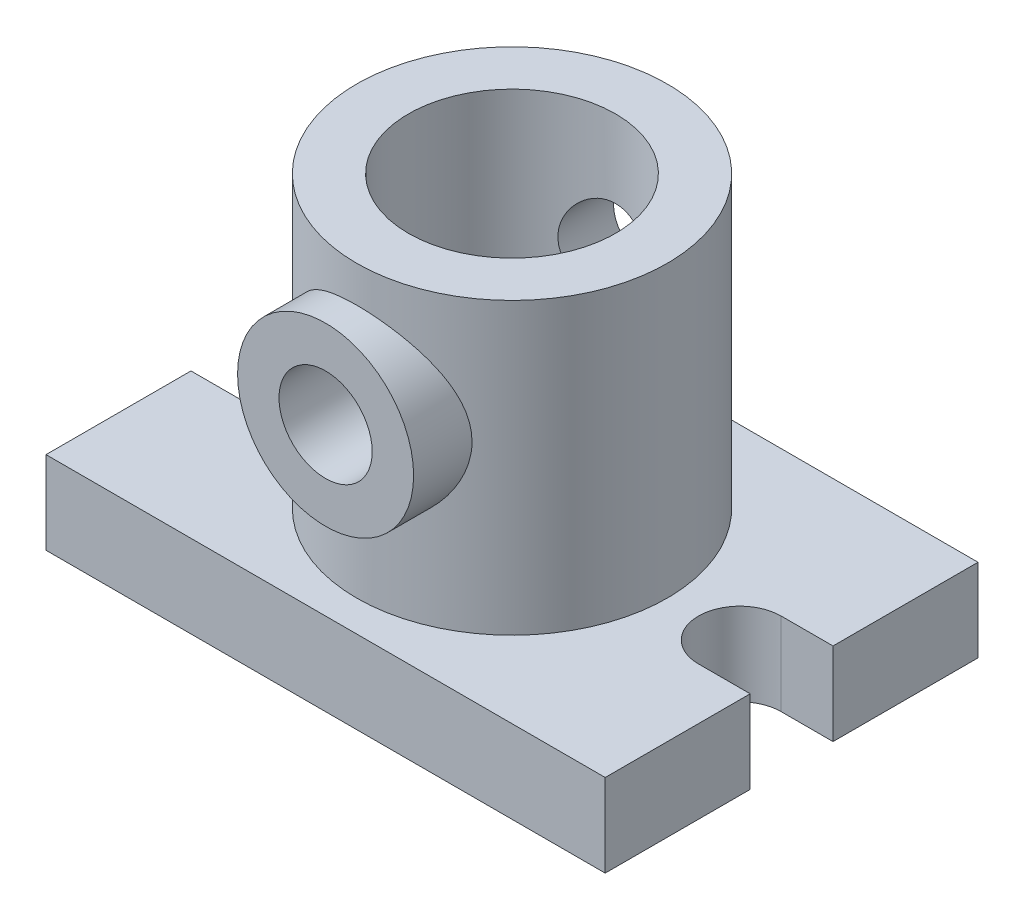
ISO-10303-21;
HEADER;
FILE_DESCRIPTION(('STEP AP214'),'2;1');
FILE_NAME('part.step','',(''),(''),'','','');
FILE_SCHEMA(('AUTOMOTIVE_DESIGN { 1 0 10303 214 1 1 1 1 }'));
ENDSEC;
DATA;
#1=APPLICATION_CONTEXT('core data for automotive mechanical design processes');
#2=APPLICATION_PROTOCOL_DEFINITION('international standard','automotive_design',2000,#1);
#3=PRODUCT_CONTEXT('',#1,'mechanical');
#4=PRODUCT('Part','Part','',(#3));
#5=PRODUCT_RELATED_PRODUCT_CATEGORY('part','',(#4));
#6=PRODUCT_DEFINITION_FORMATION('','',#4);
#7=PRODUCT_DEFINITION_CONTEXT('part definition',#1,'design');
#8=PRODUCT_DEFINITION('design','',#6,#7);
#9=PRODUCT_DEFINITION_SHAPE('','',#8);
#10=(LENGTH_UNIT() NAMED_UNIT(*) SI_UNIT(.MILLI.,.METRE.));
#11=(NAMED_UNIT(*) PLANE_ANGLE_UNIT() SI_UNIT($,.RADIAN.));
#12=(NAMED_UNIT(*) SI_UNIT($,.STERADIAN.) SOLID_ANGLE_UNIT());
#13=UNCERTAINTY_MEASURE_WITH_UNIT(LENGTH_MEASURE(1.E-05),#10,'distance_accuracy_value','');
#14=(GEOMETRIC_REPRESENTATION_CONTEXT(3) GLOBAL_UNCERTAINTY_ASSIGNED_CONTEXT((#13)) GLOBAL_UNIT_ASSIGNED_CONTEXT((#10,
#11,#12)) REPRESENTATION_CONTEXT('',''));
#15=CARTESIAN_POINT('',(0.,0.,0.));
#16=DIRECTION('',(0.,0.,1.));
#17=DIRECTION('',(1.,0.,0.));
#18=AXIS2_PLACEMENT_3D('',#15,#16,#17);
#19=CARTESIAN_POINT('',(0.,8.,0.));
#20=DIRECTION('',(0.,-1.,0.));
#21=DIRECTION('',(0.,0.,-1.));
#22=AXIS2_PLACEMENT_3D('',#19,#20,#21);
#23=CYLINDRICAL_SURFACE('',#22,4.5);
#24=CARTESIAN_POINT('',(0.,0.,0.));
#25=DIRECTION('',(0.,1.,0.));
#26=DIRECTION('',(0.,0.,1.));
#27=AXIS2_PLACEMENT_3D('',#24,#25,#26);
#28=CIRCLE('',#27,4.5);
#29=CARTESIAN_POINT('',(0.,0.,4.5));
#30=VERTEX_POINT('',#29);
#31=EDGE_CURVE('E159',#30,#30,#28,.T.);
#32=ORIENTED_EDGE('',*,*,#31,.F.);
#33=EDGE_LOOP('',(#32));
#34=FACE_BOUND('',#33,.T.);
#35=CARTESIAN_POINT('',(0.,13.,0.));
#36=DIRECTION('',(0.,1.,0.));
#37=DIRECTION('',(0.,0.,1.));
#38=AXIS2_PLACEMENT_3D('',#35,#36,#37);
#39=CIRCLE('',#38,4.5);
#40=CARTESIAN_POINT('',(0.,13.,4.5));
#41=VERTEX_POINT('',#40);
#42=EDGE_CURVE('E201',#41,#41,#39,.T.);
#43=ORIENTED_EDGE('',*,*,#42,.T.);
#44=EDGE_LOOP('',(#43));
#45=FACE_BOUND('',#44,.T.);
#46=ADVANCED_FACE('F31',(#34,#45),#23,.F.);
#47=CARTESIAN_POINT('',(-22.,8.,0.));
#48=DIRECTION('',(0.,1.,0.));
#49=DIRECTION('',(0.,0.,1.));
#50=AXIS2_PLACEMENT_3D('',#47,#48,#49);
#51=PLANE('',#50);
#52=DIRECTION('',(0.,0.,-1.));
#53=VECTOR('',#52,1.);
#54=CARTESIAN_POINT('',(27.,8.,-4.00000000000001));
#55=LINE('',#54,#53);
#56=CARTESIAN_POINT('',(27.,8.,-4.00000000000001));
#57=VERTEX_POINT('',#56);
#58=CARTESIAN_POINT('',(27.,8.,-18.));
#59=VERTEX_POINT('',#58);
#60=EDGE_CURVE('E178',#57,#59,#55,.T.);
#61=ORIENTED_EDGE('',*,*,#60,.T.);
#62=DIRECTION('',(-1.,0.,0.));
#63=VECTOR('',#62,1.);
#64=CARTESIAN_POINT('',(-27.,8.,-18.));
#65=LINE('',#64,#63);
#66=CARTESIAN_POINT('',(-27.,8.,-18.));
#67=VERTEX_POINT('',#66);
#68=EDGE_CURVE('E105',#59,#67,#65,.T.);
#69=ORIENTED_EDGE('',*,*,#68,.T.);
#70=DIRECTION('',(0.,0.,1.));
#71=VECTOR('',#70,1.);
#72=CARTESIAN_POINT('',(-27.,8.,-4.00000000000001));
#73=LINE('',#72,#71);
#74=CARTESIAN_POINT('',(-27.,8.,-4.00000000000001));
#75=VERTEX_POINT('',#74);
#76=EDGE_CURVE('E232',#67,#75,#73,.T.);
#77=ORIENTED_EDGE('',*,*,#76,.T.);
#78=DIRECTION('',(1.,0.,0.));
#79=VECTOR('',#78,1.);
#80=CARTESIAN_POINT('',(-22.,8.,-4.00000000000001));
#81=LINE('',#80,#79);
#82=CARTESIAN_POINT('',(-22.,8.,-4.00000000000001));
#83=VERTEX_POINT('',#82);
#84=EDGE_CURVE('E234',#75,#83,#81,.T.);
#85=ORIENTED_EDGE('',*,*,#84,.T.);
#86=CARTESIAN_POINT('',(-22.,8.,0.));
#87=DIRECTION('',(0.,-1.,0.));
#88=DIRECTION('',(0.,0.,1.));
#89=AXIS2_PLACEMENT_3D('',#86,#87,#88);
#90=CIRCLE('',#89,4.00000000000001);
#91=CARTESIAN_POINT('',(-22.,8.,4.00000000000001));
#92=VERTEX_POINT('',#91);
#93=EDGE_CURVE('E236',#83,#92,#90,.T.);
#94=ORIENTED_EDGE('',*,*,#93,.T.);
#95=DIRECTION('',(-1.,0.,0.));
#96=VECTOR('',#95,1.);
#97=CARTESIAN_POINT('',(-22.,8.,4.00000000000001));
#98=LINE('',#97,#96);
#99=CARTESIAN_POINT('',(-27.,8.,4.00000000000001));
#100=VERTEX_POINT('',#99);
#101=EDGE_CURVE('E238',#92,#100,#98,.T.);
#102=ORIENTED_EDGE('',*,*,#101,.T.);
#103=DIRECTION('',(0.,0.,1.));
#104=VECTOR('',#103,1.);
#105=CARTESIAN_POINT('',(-27.,8.,4.00000000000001));
#106=LINE('',#105,#104);
#107=CARTESIAN_POINT('',(-27.,8.,18.));
#108=VERTEX_POINT('',#107);
#109=EDGE_CURVE('E240',#100,#108,#106,.T.);
#110=ORIENTED_EDGE('',*,*,#109,.T.);
#111=DIRECTION('',(1.,0.,0.));
#112=VECTOR('',#111,1.);
#113=CARTESIAN_POINT('',(-27.,8.,18.));
#114=LINE('',#113,#112);
#115=CARTESIAN_POINT('',(27.,8.,18.));
#116=VERTEX_POINT('',#115);
#117=EDGE_CURVE('E242',#108,#116,#114,.T.);
#118=ORIENTED_EDGE('',*,*,#117,.T.);
#119=DIRECTION('',(0.,0.,-1.));
#120=VECTOR('',#119,1.);
#121=CARTESIAN_POINT('',(27.,8.,4.00000000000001));
#122=LINE('',#121,#120);
#123=CARTESIAN_POINT('',(27.,8.,4.00000000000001));
#124=VERTEX_POINT('',#123);
#125=EDGE_CURVE('E137',#116,#124,#122,.T.);
#126=ORIENTED_EDGE('',*,*,#125,.T.);
#127=DIRECTION('',(-1.,0.,0.));
#128=VECTOR('',#127,1.);
#129=CARTESIAN_POINT('',(22.,8.,4.00000000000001));
#130=LINE('',#129,#128);
#131=CARTESIAN_POINT('',(22.,8.,4.00000000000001));
#132=VERTEX_POINT('',#131);
#133=EDGE_CURVE('E130',#124,#132,#130,.T.);
#134=ORIENTED_EDGE('',*,*,#133,.T.);
#135=CARTESIAN_POINT('',(22.,8.,0.));
#136=DIRECTION('',(0.,-1.,0.));
#137=DIRECTION('',(0.,0.,-1.));
#138=AXIS2_PLACEMENT_3D('',#135,#136,#137);
#139=CIRCLE('',#138,4.00000000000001);
#140=CARTESIAN_POINT('',(22.,8.,-4.00000000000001));
#141=VERTEX_POINT('',#140);
#142=EDGE_CURVE('E135',#132,#141,#139,.T.);
#143=ORIENTED_EDGE('',*,*,#142,.T.);
#144=DIRECTION('',(1.,0.,0.));
#145=VECTOR('',#144,1.);
#146=CARTESIAN_POINT('',(22.,8.,-4.00000000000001));
#147=LINE('',#146,#145);
#148=EDGE_CURVE('E50',#141,#57,#147,.T.);
#149=ORIENTED_EDGE('',*,*,#148,.T.);
#150=EDGE_LOOP('',(#61,#69,#77,#85,#94,#102,#110,#118,#126,#134,#143,#149));
#151=FACE_BOUND('',#150,.T.);
#152=CARTESIAN_POINT('',(0.,8.,0.));
#153=DIRECTION('',(0.,1.,0.));
#154=DIRECTION('',(0.,0.,1.));
#155=AXIS2_PLACEMENT_3D('',#152,#153,#154);
#156=CIRCLE('',#155,15.);
#157=CARTESIAN_POINT('',(0.,8.,15.));
#158=VERTEX_POINT('',#157);
#159=EDGE_CURVE('E208',#158,#158,#156,.F.);
#160=ORIENTED_EDGE('',*,*,#159,.T.);
#161=EDGE_LOOP('',(#160));
#162=FACE_BOUND('',#161,.T.);
#163=ADVANCED_FACE('F132',(#151,#162),#51,.T.);
#164=CARTESIAN_POINT('',(-22.,0.,0.));
#165=DIRECTION('',(0.,1.,0.));
#166=DIRECTION('',(0.,0.,1.));
#167=AXIS2_PLACEMENT_3D('',#164,#165,#166);
#168=PLANE('',#167);
#169=ORIENTED_EDGE('',*,*,#31,.T.);
#170=EDGE_LOOP('',(#169));
#171=FACE_BOUND('',#170,.T.);
#172=DIRECTION('',(0.,0.,-1.));
#173=VECTOR('',#172,1.);
#174=CARTESIAN_POINT('',(27.,0.,-4.00000000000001));
#175=LINE('',#174,#173);
#176=CARTESIAN_POINT('',(27.,0.,-4.00000000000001));
#177=VERTEX_POINT('',#176);
#178=CARTESIAN_POINT('',(27.,0.,-18.));
#179=VERTEX_POINT('',#178);
#180=EDGE_CURVE('E155',#177,#179,#175,.T.);
#181=ORIENTED_EDGE('',*,*,#180,.F.);
#182=DIRECTION('',(1.,0.,0.));
#183=VECTOR('',#182,1.);
#184=CARTESIAN_POINT('',(22.,0.,-4.00000000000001));
#185=LINE('',#184,#183);
#186=CARTESIAN_POINT('',(22.,0.,-4.00000000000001));
#187=VERTEX_POINT('',#186);
#188=EDGE_CURVE('E97',#187,#177,#185,.T.);
#189=ORIENTED_EDGE('',*,*,#188,.F.);
#190=CARTESIAN_POINT('',(22.,0.,0.));
#191=DIRECTION('',(0.,-1.,0.));
#192=DIRECTION('',(0.,0.,-1.));
#193=AXIS2_PLACEMENT_3D('',#190,#191,#192);
#194=CIRCLE('',#193,4.00000000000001);
#195=CARTESIAN_POINT('',(22.,0.,4.00000000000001));
#196=VERTEX_POINT('',#195);
#197=EDGE_CURVE('E91',#196,#187,#194,.T.);
#198=ORIENTED_EDGE('',*,*,#197,.F.);
#199=DIRECTION('',(-1.,0.,0.));
#200=VECTOR('',#199,1.);
#201=CARTESIAN_POINT('',(22.,0.,4.00000000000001));
#202=LINE('',#201,#200);
#203=CARTESIAN_POINT('',(27.,0.,4.00000000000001));
#204=VERTEX_POINT('',#203);
#205=EDGE_CURVE('E145',#204,#196,#202,.T.);
#206=ORIENTED_EDGE('',*,*,#205,.F.);
#207=DIRECTION('',(0.,0.,-1.));
#208=VECTOR('',#207,1.);
#209=CARTESIAN_POINT('',(27.,0.,4.00000000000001));
#210=LINE('',#209,#208);
#211=CARTESIAN_POINT('',(27.,0.,18.));
#212=VERTEX_POINT('',#211);
#213=EDGE_CURVE('E173',#212,#204,#210,.T.);
#214=ORIENTED_EDGE('',*,*,#213,.F.);
#215=DIRECTION('',(1.,0.,0.));
#216=VECTOR('',#215,1.);
#217=CARTESIAN_POINT('',(-27.,0.,18.));
#218=LINE('',#217,#216);
#219=CARTESIAN_POINT('',(-27.,0.,18.));
#220=VERTEX_POINT('',#219);
#221=EDGE_CURVE('E171',#220,#212,#218,.T.);
#222=ORIENTED_EDGE('',*,*,#221,.F.);
#223=DIRECTION('',(0.,0.,1.));
#224=VECTOR('',#223,1.);
#225=CARTESIAN_POINT('',(-27.,0.,4.00000000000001));
#226=LINE('',#225,#224);
#227=CARTESIAN_POINT('',(-27.,0.,4.00000000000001));
#228=VERTEX_POINT('',#227);
#229=EDGE_CURVE('E169',#228,#220,#226,.T.);
#230=ORIENTED_EDGE('',*,*,#229,.F.);
#231=DIRECTION('',(-1.,0.,0.));
#232=VECTOR('',#231,1.);
#233=CARTESIAN_POINT('',(-22.,0.,4.00000000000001));
#234=LINE('',#233,#232);
#235=CARTESIAN_POINT('',(-22.,0.,4.00000000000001));
#236=VERTEX_POINT('',#235);
#237=EDGE_CURVE('E167',#236,#228,#234,.T.);
#238=ORIENTED_EDGE('',*,*,#237,.F.);
#239=CARTESIAN_POINT('',(-22.,0.,0.));
#240=DIRECTION('',(0.,-1.,0.));
#241=DIRECTION('',(0.,0.,1.));
#242=AXIS2_PLACEMENT_3D('',#239,#240,#241);
#243=CIRCLE('',#242,4.00000000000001);
#244=CARTESIAN_POINT('',(-22.,0.,-4.00000000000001));
#245=VERTEX_POINT('',#244);
#246=EDGE_CURVE('E165',#245,#236,#243,.T.);
#247=ORIENTED_EDGE('',*,*,#246,.F.);
#248=DIRECTION('',(1.,0.,0.));
#249=VECTOR('',#248,1.);
#250=CARTESIAN_POINT('',(-22.,0.,-4.00000000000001));
#251=LINE('',#250,#249);
#252=CARTESIAN_POINT('',(-27.,0.,-4.00000000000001));
#253=VERTEX_POINT('',#252);
#254=EDGE_CURVE('E163',#253,#245,#251,.T.);
#255=ORIENTED_EDGE('',*,*,#254,.F.);
#256=DIRECTION('',(0.,0.,1.));
#257=VECTOR('',#256,1.);
#258=CARTESIAN_POINT('',(-27.,0.,-4.00000000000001));
#259=LINE('',#258,#257);
#260=CARTESIAN_POINT('',(-27.,0.,-18.));
#261=VERTEX_POINT('',#260);
#262=EDGE_CURVE('E161',#261,#253,#259,.T.);
#263=ORIENTED_EDGE('',*,*,#262,.F.);
#264=DIRECTION('',(-1.,0.,0.));
#265=VECTOR('',#264,1.);
#266=CARTESIAN_POINT('',(-27.,0.,-18.));
#267=LINE('',#266,#265);
#268=EDGE_CURVE('E158',#179,#261,#267,.T.);
#269=ORIENTED_EDGE('',*,*,#268,.F.);
#270=EDGE_LOOP('',(#181,#189,#198,#206,#214,#222,#230,#238,#247,#255,#263,#269));
#271=FACE_BOUND('',#270,.T.);
#272=ADVANCED_FACE('F255',(#171,#271),#168,.F.);
#273=CARTESIAN_POINT('',(27.,8.,-4.00000000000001));
#274=DIRECTION('',(-1.,0.,0.));
#275=DIRECTION('',(0.,0.,1.));
#276=AXIS2_PLACEMENT_3D('',#273,#274,#275);
#277=PLANE('',#276);
#278=ORIENTED_EDGE('',*,*,#180,.T.);
#279=DIRECTION('',(0.,-1.,0.));
#280=VECTOR('',#279,1.);
#281=CARTESIAN_POINT('',(27.,8.,-18.));
#282=LINE('',#281,#280);
#283=EDGE_CURVE('E11',#59,#179,#282,.T.);
#284=ORIENTED_EDGE('',*,*,#283,.F.);
#285=ORIENTED_EDGE('',*,*,#60,.F.);
#286=DIRECTION('',(0.,-1.,0.));
#287=VECTOR('',#286,1.);
#288=CARTESIAN_POINT('',(27.,8.,-4.00000000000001));
#289=LINE('',#288,#287);
#290=EDGE_CURVE('E151',#57,#177,#289,.T.);
#291=ORIENTED_EDGE('',*,*,#290,.T.);
#292=EDGE_LOOP('',(#278,#284,#285,#291));
#293=FACE_BOUND('',#292,.T.);
#294=ADVANCED_FACE('F33',(#293),#277,.F.);
#295=CARTESIAN_POINT('',(-27.,8.,-18.));
#296=DIRECTION('',(0.,0.,1.));
#297=DIRECTION('',(1.,0.,0.));
#298=AXIS2_PLACEMENT_3D('',#295,#296,#297);
#299=PLANE('',#298);
#300=ORIENTED_EDGE('',*,*,#268,.T.);
#301=DIRECTION('',(0.,-1.,0.));
#302=VECTOR('',#301,1.);
#303=CARTESIAN_POINT('',(-27.,8.,-18.));
#304=LINE('',#303,#302);
#305=EDGE_CURVE('E41',#67,#261,#304,.T.);
#306=ORIENTED_EDGE('',*,*,#305,.F.);
#307=ORIENTED_EDGE('',*,*,#68,.F.);
#308=ORIENTED_EDGE('',*,*,#283,.T.);
#309=EDGE_LOOP('',(#300,#306,#307,#308));
#310=FACE_BOUND('',#309,.T.);
#311=ADVANCED_FACE('F288',(#310),#299,.F.);
#312=CARTESIAN_POINT('',(-27.,8.,-4.00000000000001));
#313=DIRECTION('',(1.,0.,0.));
#314=DIRECTION('',(0.,0.,-1.));
#315=AXIS2_PLACEMENT_3D('',#312,#313,#314);
#316=PLANE('',#315);
#317=ORIENTED_EDGE('',*,*,#262,.T.);
#318=DIRECTION('',(0.,-1.,0.));
#319=VECTOR('',#318,1.);
#320=CARTESIAN_POINT('',(-27.,8.,-4.00000000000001));
#321=LINE('',#320,#319);
#322=EDGE_CURVE('E197',#75,#253,#321,.T.);
#323=ORIENTED_EDGE('',*,*,#322,.F.);
#324=ORIENTED_EDGE('',*,*,#76,.F.);
#325=ORIENTED_EDGE('',*,*,#305,.T.);
#326=EDGE_LOOP('',(#317,#323,#324,#325));
#327=FACE_BOUND('',#326,.T.);
#328=ADVANCED_FACE('F292',(#327),#316,.F.);
#329=CARTESIAN_POINT('',(-22.,8.,-4.00000000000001));
#330=DIRECTION('',(0.,0.,-1.));
#331=DIRECTION('',(-1.,0.,0.));
#332=AXIS2_PLACEMENT_3D('',#329,#330,#331);
#333=PLANE('',#332);
#334=ORIENTED_EDGE('',*,*,#254,.T.);
#335=DIRECTION('',(0.,-1.,0.));
#336=VECTOR('',#335,1.);
#337=CARTESIAN_POINT('',(-22.,8.,-4.00000000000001));
#338=LINE('',#337,#336);
#339=EDGE_CURVE('E194',#83,#245,#338,.T.);
#340=ORIENTED_EDGE('',*,*,#339,.F.);
#341=ORIENTED_EDGE('',*,*,#84,.F.);
#342=ORIENTED_EDGE('',*,*,#322,.T.);
#343=EDGE_LOOP('',(#334,#340,#341,#342));
#344=FACE_BOUND('',#343,.T.);
#345=ADVANCED_FACE('F296',(#344),#333,.F.);
#346=CARTESIAN_POINT('',(-22.,8.,0.));
#347=DIRECTION('',(0.,-1.,0.));
#348=DIRECTION('',(0.,0.,-1.));
#349=AXIS2_PLACEMENT_3D('',#346,#347,#348);
#350=CYLINDRICAL_SURFACE('',#349,4.00000000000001);
#351=ORIENTED_EDGE('',*,*,#246,.T.);
#352=DIRECTION('',(0.,-1.,0.));
#353=VECTOR('',#352,1.);
#354=CARTESIAN_POINT('',(-22.,8.,4.00000000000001));
#355=LINE('',#354,#353);
#356=EDGE_CURVE('E191',#92,#236,#355,.T.);
#357=ORIENTED_EDGE('',*,*,#356,.F.);
#358=ORIENTED_EDGE('',*,*,#93,.F.);
#359=ORIENTED_EDGE('',*,*,#339,.T.);
#360=EDGE_LOOP('',(#351,#357,#358,#359));
#361=FACE_BOUND('',#360,.T.);
#362=ADVANCED_FACE('F302',(#361),#350,.F.);
#363=CARTESIAN_POINT('',(-22.,8.,4.00000000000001));
#364=DIRECTION('',(0.,0.,1.));
#365=DIRECTION('',(1.,0.,0.));
#366=AXIS2_PLACEMENT_3D('',#363,#364,#365);
#367=PLANE('',#366);
#368=ORIENTED_EDGE('',*,*,#237,.T.);
#369=DIRECTION('',(0.,-1.,0.));
#370=VECTOR('',#369,1.);
#371=CARTESIAN_POINT('',(-27.,8.,4.00000000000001));
#372=LINE('',#371,#370);
#373=EDGE_CURVE('E188',#100,#228,#372,.T.);
#374=ORIENTED_EDGE('',*,*,#373,.F.);
#375=ORIENTED_EDGE('',*,*,#101,.F.);
#376=ORIENTED_EDGE('',*,*,#356,.T.);
#377=EDGE_LOOP('',(#368,#374,#375,#376));
#378=FACE_BOUND('',#377,.T.);
#379=ADVANCED_FACE('F306',(#378),#367,.F.);
#380=CARTESIAN_POINT('',(-27.,8.,4.00000000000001));
#381=DIRECTION('',(1.,0.,0.));
#382=DIRECTION('',(0.,0.,-1.));
#383=AXIS2_PLACEMENT_3D('',#380,#381,#382);
#384=PLANE('',#383);
#385=ORIENTED_EDGE('',*,*,#229,.T.);
#386=DIRECTION('',(0.,-1.,0.));
#387=VECTOR('',#386,1.);
#388=CARTESIAN_POINT('',(-27.,8.,18.));
#389=LINE('',#388,#387);
#390=EDGE_CURVE('E185',#108,#220,#389,.T.);
#391=ORIENTED_EDGE('',*,*,#390,.F.);
#392=ORIENTED_EDGE('',*,*,#109,.F.);
#393=ORIENTED_EDGE('',*,*,#373,.T.);
#394=EDGE_LOOP('',(#385,#391,#392,#393));
#395=FACE_BOUND('',#394,.T.);
#396=ADVANCED_FACE('F310',(#395),#384,.F.);
#397=CARTESIAN_POINT('',(-27.,8.,18.));
#398=DIRECTION('',(0.,0.,-1.));
#399=DIRECTION('',(-1.,0.,0.));
#400=AXIS2_PLACEMENT_3D('',#397,#398,#399);
#401=PLANE('',#400);
#402=ORIENTED_EDGE('',*,*,#221,.T.);
#403=DIRECTION('',(0.,-1.,0.));
#404=VECTOR('',#403,1.);
#405=CARTESIAN_POINT('',(27.,8.,18.));
#406=LINE('',#405,#404);
#407=EDGE_CURVE('E182',#116,#212,#406,.T.);
#408=ORIENTED_EDGE('',*,*,#407,.F.);
#409=ORIENTED_EDGE('',*,*,#117,.F.);
#410=ORIENTED_EDGE('',*,*,#390,.T.);
#411=EDGE_LOOP('',(#402,#408,#409,#410));
#412=FACE_BOUND('',#411,.T.);
#413=ADVANCED_FACE('F248',(#412),#401,.F.);
#414=CARTESIAN_POINT('',(27.,8.,4.00000000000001));
#415=DIRECTION('',(-1.,0.,0.));
#416=DIRECTION('',(0.,0.,1.));
#417=AXIS2_PLACEMENT_3D('',#414,#415,#416);
#418=PLANE('',#417);
#419=ORIENTED_EDGE('',*,*,#213,.T.);
#420=DIRECTION('',(0.,-1.,0.));
#421=VECTOR('',#420,1.);
#422=CARTESIAN_POINT('',(27.,8.,4.00000000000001));
#423=LINE('',#422,#421);
#424=EDGE_CURVE('E146',#124,#204,#423,.T.);
#425=ORIENTED_EDGE('',*,*,#424,.F.);
#426=ORIENTED_EDGE('',*,*,#125,.F.);
#427=ORIENTED_EDGE('',*,*,#407,.T.);
#428=EDGE_LOOP('',(#419,#425,#426,#427));
#429=FACE_BOUND('',#428,.T.);
#430=ADVANCED_FACE('F252',(#429),#418,.F.);
#431=CARTESIAN_POINT('',(22.,8.,4.00000000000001));
#432=DIRECTION('',(0.,0.,1.));
#433=DIRECTION('',(1.,0.,0.));
#434=AXIS2_PLACEMENT_3D('',#431,#432,#433);
#435=PLANE('',#434);
#436=ORIENTED_EDGE('',*,*,#205,.T.);
#437=DIRECTION('',(0.,-1.,0.));
#438=VECTOR('',#437,1.);
#439=CARTESIAN_POINT('',(22.,8.,4.00000000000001));
#440=LINE('',#439,#438);
#441=EDGE_CURVE('E142',#132,#196,#440,.T.);
#442=ORIENTED_EDGE('',*,*,#441,.F.);
#443=ORIENTED_EDGE('',*,*,#133,.F.);
#444=ORIENTED_EDGE('',*,*,#424,.T.);
#445=EDGE_LOOP('',(#436,#442,#443,#444));
#446=FACE_BOUND('',#445,.T.);
#447=ADVANCED_FACE('F143',(#446),#435,.F.);
#448=CARTESIAN_POINT('',(22.,8.,0.));
#449=DIRECTION('',(0.,-1.,0.));
#450=DIRECTION('',(0.,0.,-1.));
#451=AXIS2_PLACEMENT_3D('',#448,#449,#450);
#452=CYLINDRICAL_SURFACE('',#451,4.00000000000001);
#453=ORIENTED_EDGE('',*,*,#197,.T.);
#454=DIRECTION('',(0.,-1.,0.));
#455=VECTOR('',#454,1.);
#456=CARTESIAN_POINT('',(22.,8.,-4.00000000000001));
#457=LINE('',#456,#455);
#458=EDGE_CURVE('E147',#141,#187,#457,.T.);
#459=ORIENTED_EDGE('',*,*,#458,.F.);
#460=ORIENTED_EDGE('',*,*,#142,.F.);
#461=ORIENTED_EDGE('',*,*,#441,.T.);
#462=EDGE_LOOP('',(#453,#459,#460,#461));
#463=FACE_BOUND('',#462,.T.);
#464=ADVANCED_FACE('F149',(#463),#452,.F.);
#465=CARTESIAN_POINT('',(22.,8.,-4.00000000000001));
#466=DIRECTION('',(0.,0.,-1.));
#467=DIRECTION('',(-1.,0.,0.));
#468=AXIS2_PLACEMENT_3D('',#465,#466,#467);
#469=PLANE('',#468);
#470=ORIENTED_EDGE('',*,*,#188,.T.);
#471=ORIENTED_EDGE('',*,*,#290,.F.);
#472=ORIENTED_EDGE('',*,*,#148,.F.);
#473=ORIENTED_EDGE('',*,*,#458,.T.);
#474=EDGE_LOOP('',(#470,#471,#472,#473));
#475=FACE_BOUND('',#474,.T.);
#476=ADVANCED_FACE('F260',(#475),#469,.F.);
#477=CARTESIAN_POINT('',(0.,36.,0.));
#478=DIRECTION('',(0.,1.,0.));
#479=DIRECTION('',(0.,0.,1.));
#480=AXIS2_PLACEMENT_3D('',#477,#478,#479);
#481=PLANE('',#480);
#482=CARTESIAN_POINT('',(0.,36.,0.));
#483=DIRECTION('',(0.,1.,0.));
#484=DIRECTION('',(0.,0.,1.));
#485=AXIS2_PLACEMENT_3D('',#482,#483,#484);
#486=CIRCLE('',#485,10.);
#487=CARTESIAN_POINT('',(0.,36.,10.));
#488=VERTEX_POINT('',#487);
#489=EDGE_CURVE('E211',#488,#488,#486,.T.);
#490=ORIENTED_EDGE('',*,*,#489,.F.);
#491=EDGE_LOOP('',(#490));
#492=FACE_BOUND('',#491,.T.);
#493=CARTESIAN_POINT('',(0.,36.,0.));
#494=DIRECTION('',(0.,1.,0.));
#495=DIRECTION('',(0.,0.,1.));
#496=AXIS2_PLACEMENT_3D('',#493,#494,#495);
#497=CIRCLE('',#496,15.);
#498=CARTESIAN_POINT('',(0.,36.,15.));
#499=VERTEX_POINT('',#498);
#500=EDGE_CURVE('E203',#499,#499,#497,.T.);
#501=ORIENTED_EDGE('',*,*,#500,.T.);
#502=EDGE_LOOP('',(#501));
#503=FACE_BOUND('',#502,.T.);
#504=ADVANCED_FACE('F262',(#492,#503),#481,.T.);
#505=CARTESIAN_POINT('',(0.,36.,0.));
#506=DIRECTION('',(0.,-1.,0.));
#507=DIRECTION('',(0.,0.,-1.));
#508=AXIS2_PLACEMENT_3D('',#505,#506,#507);
#509=CYLINDRICAL_SURFACE('',#508,15.);
#510=CARTESIAN_POINT('',(0.,28.5,-15.));
#511=CARTESIAN_POINT('',(-0.2468658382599,28.4999970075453,-14.9999978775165));
#512=CARTESIAN_POINT('',(-0.493761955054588,28.4796184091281,-14.9938474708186));
#513=CARTESIAN_POINT('',(-0.980364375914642,28.3988359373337,-14.9699131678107));
#514=CARTESIAN_POINT('',(-1.22006851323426,28.33842012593,-14.9521258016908));
#515=CARTESIAN_POINT('',(-1.68519812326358,28.1797619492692,-14.9068665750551));
#516=CARTESIAN_POINT('',(-1.91064409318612,28.0815753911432,-14.8794090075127));
#517=CARTESIAN_POINT('',(-2.34187254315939,27.8503917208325,-14.8176632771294));
#518=CARTESIAN_POINT('',(-2.54765240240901,27.7173899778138,-14.7833742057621));
#519=CARTESIAN_POINT('',(-2.93961539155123,27.416327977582,-14.7105221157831));
#520=CARTESIAN_POINT('',(-3.12515421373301,27.2474501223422,-14.6718715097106));
#521=CARTESIAN_POINT('',(-3.46574762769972,26.8811723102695,-14.5951750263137));
#522=CARTESIAN_POINT('',(-3.62079708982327,26.6837675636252,-14.5571292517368));
#523=CARTESIAN_POINT('',(-3.89940113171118,26.2605877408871,-14.4850234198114));
#524=CARTESIAN_POINT('',(-4.02216927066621,26.0342746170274,-14.4510721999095));
#525=CARTESIAN_POINT('',(-4.227641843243,25.5630322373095,-14.3923086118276));
#526=CARTESIAN_POINT('',(-4.31035589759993,25.3181074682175,-14.3674940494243));
#527=CARTESIAN_POINT('',(-4.43104901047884,24.8238292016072,-14.3307261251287));
#528=CARTESIAN_POINT('',(-4.47021588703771,24.5747917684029,-14.3184320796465));
#529=CARTESIAN_POINT('',(-4.50641191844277,24.0734005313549,-14.3070836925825));
#530=CARTESIAN_POINT('',(-4.5034512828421,23.8210475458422,-14.3080261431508));
#531=CARTESIAN_POINT('',(-4.45640931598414,23.3298482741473,-14.3227423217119));
#532=CARTESIAN_POINT('',(-4.41381615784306,23.0908432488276,-14.3360516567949));
#533=CARTESIAN_POINT('',(-4.29112261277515,22.6235406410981,-14.373250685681));
#534=CARTESIAN_POINT('',(-4.2110185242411,22.3952441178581,-14.3971414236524));
#535=CARTESIAN_POINT('',(-4.01448079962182,21.952198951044,-14.4531819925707));
#536=CARTESIAN_POINT('',(-3.89756450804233,21.7376787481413,-14.4854404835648));
#537=CARTESIAN_POINT('',(-3.63105667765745,21.3308039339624,-14.5545296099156));
#538=CARTESIAN_POINT('',(-3.48145722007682,21.1384547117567,-14.5913613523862));
#539=CARTESIAN_POINT('',(-3.14643872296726,20.7729414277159,-14.6673303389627));
#540=CARTESIAN_POINT('',(-2.95978472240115,20.6009140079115,-14.7064996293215));
#541=CARTESIAN_POINT('',(-2.55978977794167,20.2903380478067,-14.7813673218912));
#542=CARTESIAN_POINT('',(-2.3464471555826,20.1517916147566,-14.8170655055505));
#543=CARTESIAN_POINT('',(-1.89706511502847,19.911420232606,-14.8812948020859));
#544=CARTESIAN_POINT('',(-1.66088324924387,19.8098474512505,-14.9097763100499));
#545=CARTESIAN_POINT('',(-1.17373624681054,19.6482012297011,-14.9560056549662));
#546=CARTESIAN_POINT('',(-0.92277525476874,19.5881162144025,-14.9737564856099));
#547=CARTESIAN_POINT('',(-0.422856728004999,19.5130434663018,-14.9960509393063));
#548=CARTESIAN_POINT('',(-0.174150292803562,19.4965152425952,-15.0010455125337));
#549=CARTESIAN_POINT('',(0.32249881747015,19.5047074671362,-14.9985876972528));
#550=CARTESIAN_POINT('',(0.570441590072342,19.5294224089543,-14.9911369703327));
#551=CARTESIAN_POINT('',(1.05271081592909,19.6181538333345,-14.9649209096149));
#552=CARTESIAN_POINT('',(1.28721831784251,19.6812701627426,-14.9464148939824));
#553=CARTESIAN_POINT('',(1.74226391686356,19.8439296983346,-14.900230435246));
#554=CARTESIAN_POINT('',(1.96280033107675,19.9434772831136,-14.8725508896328));
#555=CARTESIAN_POINT('',(2.38931156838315,20.1787594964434,-14.8100896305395));
#556=CARTESIAN_POINT('',(2.594831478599,20.3152780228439,-14.7751584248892));
#557=CARTESIAN_POINT('',(2.98056992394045,20.6196742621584,-14.7022040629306));
#558=CARTESIAN_POINT('',(3.16078209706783,20.7875598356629,-14.6641801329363));
#559=CARTESIAN_POINT('',(3.49757233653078,21.1571619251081,-14.5875951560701));
#560=CARTESIAN_POINT('',(3.65305443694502,21.3598856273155,-14.5490647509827));
#561=CARTESIAN_POINT('',(3.92786985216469,21.7893838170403,-14.4772954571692));
#562=CARTESIAN_POINT('',(4.04720411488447,22.0161576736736,-14.4440564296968));
#563=CARTESIAN_POINT('',(4.24552041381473,22.4865974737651,-14.3870156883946));
#564=CARTESIAN_POINT('',(4.32469040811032,22.7301785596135,-14.3631701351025));
#565=CARTESIAN_POINT('',(4.44065192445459,23.2280639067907,-14.3277478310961));
#566=CARTESIAN_POINT('',(4.47745796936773,23.4823644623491,-14.3161668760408));
#567=CARTESIAN_POINT('',(4.50665953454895,23.9830845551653,-14.3069991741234));
#568=CARTESIAN_POINT('',(4.5008416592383,24.2293909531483,-14.3088494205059));
#569=CARTESIAN_POINT('',(4.44922516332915,24.7173423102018,-14.3249820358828));
#570=CARTESIAN_POINT('',(4.40342814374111,24.9589874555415,-14.3392639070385));
#571=CARTESIAN_POINT('',(4.27430666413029,25.427836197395,-14.3782729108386));
#572=CARTESIAN_POINT('',(4.19145526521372,25.6551818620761,-14.402868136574));
#573=CARTESIAN_POINT('',(3.99094521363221,26.0929273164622,-14.459708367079));
#574=CARTESIAN_POINT('',(3.87327989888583,26.3033238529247,-14.4919548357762));
#575=CARTESIAN_POINT('',(3.60146291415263,26.7094893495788,-14.5619302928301));
#576=CARTESIAN_POINT('',(3.44613828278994,26.9044462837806,-14.5998162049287));
#577=CARTESIAN_POINT('',(3.10552303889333,27.2661074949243,-14.676039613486));
#578=CARTESIAN_POINT('',(2.92022465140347,27.4328044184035,-14.7143772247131));
#579=CARTESIAN_POINT('',(2.51839728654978,27.7380702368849,-14.7885280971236));
#580=CARTESIAN_POINT('',(2.30111365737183,27.8756743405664,-14.8242347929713));
#581=CARTESIAN_POINT('',(1.84542412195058,28.1122055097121,-14.8878204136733));
#582=CARTESIAN_POINT('',(1.60702815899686,28.2111506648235,-14.9157029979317));
#583=CARTESIAN_POINT('',(1.14227313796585,28.3586858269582,-14.9580652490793));
#584=CARTESIAN_POINT('',(0.917360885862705,28.4115350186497,-14.9736608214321));
#585=CARTESIAN_POINT('',(0.461640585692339,28.4821905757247,-14.9946283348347));
#586=CARTESIAN_POINT('',(0.230833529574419,28.5000027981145,-15.0000019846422));
#587=CARTESIAN_POINT('',(0.,28.5,-15.));
#588=B_SPLINE_CURVE_WITH_KNOTS('',3,(#510,#511,#512,#513,#514,#515,#516,#517,#518,#519,#520,
#521,#522,#523,#524,#525,#526,#527,#528,#529,#530,#531,#532,#533,#534,#535,#536,#537,#538,#539,
#540,#541,#542,#543,#544,#545,#546,#547,#548,#549,#550,#551,#552,#553,#554,#555,#556,#557,#558,
#559,#560,#561,#562,#563,#564,#565,#566,#567,#568,#569,#570,#571,#572,#573,#574,#575,#576,#577,
#578,#579,#580,#581,#582,#583,#584,#585,#586,#587),.UNSPECIFIED.,.T.,.F.,(4,2,2,2,2,2,2,2,2,2,2,
2,2,2,2,2,2,2,2,2,2,2,2,2,2,2,2,2,2,2,2,2,2,2,2,2,2,2,4),(0.,0.739749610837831,1.479719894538,
2.21860102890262,2.9575804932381,3.71566808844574,4.47388311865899,5.24914443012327,
6.0242194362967,6.77759068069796,7.53077934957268,8.25678050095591,8.98285330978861,
9.71887279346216,10.4550708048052,11.2220131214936,11.9890036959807,12.7611314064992,
13.5330436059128,14.2772642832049,15.0213856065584,15.7487024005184,16.4761066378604,
17.2203391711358,17.9647584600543,18.7362120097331,19.507645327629,20.2754344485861,
21.0429602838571,21.7785046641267,22.5140195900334,23.240401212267,23.9669219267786,
24.7199077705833,25.4730892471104,26.2482898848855,27.0231273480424,27.7149507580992,
28.4066585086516),.UNSPECIFIED.);
#589=CARTESIAN_POINT('',(0.,28.5,-15.));
#590=VERTEX_POINT('',#589);
#591=EDGE_CURVE('E439',#590,#590,#588,.T.);
#592=ORIENTED_EDGE('',*,*,#591,.T.);
#593=EDGE_LOOP('',(#592));
#594=FACE_BOUND('',#593,.T.);
#595=CARTESIAN_POINT('',(8.5,24.,12.3592070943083));
#596=CARTESIAN_POINT('',(8.49999908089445,24.2166374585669,12.3592083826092));
#597=CARTESIAN_POINT('',(8.49170524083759,24.4332884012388,12.3649242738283));
#598=CARTESIAN_POINT('',(8.45866663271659,24.8647460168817,12.3875481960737));
#599=CARTESIAN_POINT('',(8.43392037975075,25.0795525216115,12.4044572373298));
#600=CARTESIAN_POINT('',(8.36834976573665,25.5057362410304,12.4487863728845));
#601=CARTESIAN_POINT('',(8.32751418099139,25.7171109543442,12.476213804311));
#602=CARTESIAN_POINT('',(8.23033024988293,26.1348739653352,12.5405363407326));
#603=CARTESIAN_POINT('',(8.17397476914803,26.3412599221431,12.5774357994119));
#604=CARTESIAN_POINT('',(8.04689407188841,26.7463147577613,12.6591133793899));
#605=CARTESIAN_POINT('',(7.97627056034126,26.9450270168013,12.7038354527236));
#606=CARTESIAN_POINT('',(7.82110356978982,27.3353368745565,12.7999480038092));
#607=CARTESIAN_POINT('',(7.73655492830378,27.5269318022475,12.8513409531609));
#608=CARTESIAN_POINT('',(7.55423076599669,27.9021914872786,12.9593520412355));
#609=CARTESIAN_POINT('',(7.45645524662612,28.0858562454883,13.0159701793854));
#610=CARTESIAN_POINT('',(7.24835805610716,28.4445872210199,13.1329966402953));
#611=CARTESIAN_POINT('',(7.13803595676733,28.6196531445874,13.19340509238));
#612=CARTESIAN_POINT('',(6.76390798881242,29.1680231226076,13.3915752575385));
#613=CARTESIAN_POINT('',(6.47637376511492,29.5239596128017,13.5342088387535));
#614=CARTESIAN_POINT('',(6.0052544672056,30.0198931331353,13.7465201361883));
#615=CARTESIAN_POINT('',(5.84145884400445,30.1789668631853,13.8170627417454));
#616=CARTESIAN_POINT('',(5.50101898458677,30.4838999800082,13.95609330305));
#617=CARTESIAN_POINT('',(5.32437254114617,30.629757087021,14.0245809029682));
#618=CARTESIAN_POINT('',(4.94195232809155,30.9202626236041,14.1641208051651));
#619=CARTESIAN_POINT('',(4.73499836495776,31.0635308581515,14.2348170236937));
#620=CARTESIAN_POINT('',(4.30777895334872,31.3318912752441,14.3698710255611));
#621=CARTESIAN_POINT('',(4.08751942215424,31.4569914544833,14.4342315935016));
#622=CARTESIAN_POINT('',(3.6349841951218,31.6877415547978,14.5547824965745));
#623=CARTESIAN_POINT('',(3.40271287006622,31.7933984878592,14.6109757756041));
#624=CARTESIAN_POINT('',(2.92772159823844,31.9839777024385,14.7135122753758));
#625=CARTESIAN_POINT('',(2.68500315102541,32.0689029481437,14.7598569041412));
#626=CARTESIAN_POINT('',(2.2126630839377,32.2103282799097,14.8376656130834));
#627=CARTESIAN_POINT('',(1.98374548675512,32.2686615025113,14.8700749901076));
#628=CARTESIAN_POINT('',(1.52065529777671,32.3662167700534,14.9245415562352));
#629=CARTESIAN_POINT('',(1.28648298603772,32.405439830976,14.9465992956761));
#630=CARTESIAN_POINT('',(0.81506535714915,32.4641628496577,14.9797017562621));
#631=CARTESIAN_POINT('',(0.57782223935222,32.4836762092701,14.9907539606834));
#632=CARTESIAN_POINT('',(0.102286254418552,32.5027140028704,15.0015359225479));
#633=CARTESIAN_POINT('',(-0.136006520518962,32.5022401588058,15.0012666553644));
#634=CARTESIAN_POINT('',(-0.584969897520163,32.4824849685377,14.9900801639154));
#635=CARTESIAN_POINT('',(-0.795766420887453,32.4653001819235,14.9803499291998));
#636=CARTESIAN_POINT('',(-1.21492336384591,32.4153729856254,14.9521930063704));
#637=CARTESIAN_POINT('',(-1.42328377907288,32.3826305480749,14.9337663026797));
#638=CARTESIAN_POINT('',(-1.8361244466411,32.3019808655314,14.8886457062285));
#639=CARTESIAN_POINT('',(-2.04060475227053,32.254073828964,14.8619519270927));
#640=CARTESIAN_POINT('',(-2.44439915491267,32.1436314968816,14.8008992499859));
#641=CARTESIAN_POINT('',(-2.643713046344,32.0810956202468,14.7665400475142));
#642=CARTESIAN_POINT('',(-3.03781895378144,31.9413947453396,14.6905507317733));
#643=CARTESIAN_POINT('',(-3.23255360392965,31.8641022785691,14.648857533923));
#644=CARTESIAN_POINT('',(-3.6146371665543,31.6959741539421,14.5592916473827));
#645=CARTESIAN_POINT('',(-3.80198357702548,31.6051339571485,14.5114168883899));
#646=CARTESIAN_POINT('',(-4.35157014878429,31.3133891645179,14.3599407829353));
#647=CARTESIAN_POINT('',(-4.70160710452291,31.0931709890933,14.2484376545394));
#648=CARTESIAN_POINT('',(-5.40035219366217,30.5798904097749,13.9996069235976));
#649=CARTESIAN_POINT('',(-5.7445276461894,30.2814339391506,13.8607857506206));
#650=CARTESIAN_POINT('',(-6.38087800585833,29.6338729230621,13.5795957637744));
#651=CARTESIAN_POINT('',(-6.67299033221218,29.2847083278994,13.4372229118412));
#652=CARTESIAN_POINT('',(-7.08040872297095,28.7095923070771,13.2247669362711));
#653=CARTESIAN_POINT('',(-7.21603859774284,28.499091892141,13.1510398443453));
#654=CARTESIAN_POINT('',(-7.46894293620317,28.0654464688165,13.0090694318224));
#655=CARTESIAN_POINT('',(-7.5862149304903,27.8422997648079,12.9408268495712));
#656=CARTESIAN_POINT('',(-7.80104728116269,27.3848823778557,12.8124673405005));
#657=CARTESIAN_POINT('',(-7.89863602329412,27.1506283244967,12.7523387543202));
#658=CARTESIAN_POINT('',(-8.07306520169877,26.67215108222,12.6426363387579));
#659=CARTESIAN_POINT('',(-8.149912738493,26.4279313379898,12.5930588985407));
#660=CARTESIAN_POINT('',(-8.26677048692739,25.9874800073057,12.5165574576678));
#661=CARTESIAN_POINT('',(-8.31118010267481,25.7928544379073,12.4870460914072));
#662=CARTESIAN_POINT('',(-8.38631703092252,25.3998856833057,12.4367094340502));
#663=CARTESIAN_POINT('',(-8.41704697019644,25.2015432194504,12.4158824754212));
#664=CARTESIAN_POINT('',(-8.46440789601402,24.8025729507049,12.3836433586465));
#665=CARTESIAN_POINT('',(-8.4810497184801,24.6019470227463,12.3722239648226));
#666=CARTESIAN_POINT('',(-8.50003903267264,24.1996918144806,12.3591857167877));
#667=CARTESIAN_POINT('',(-8.50238615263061,23.9980625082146,12.3575671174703));
#668=CARTESIAN_POINT('',(-8.49274790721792,23.5952210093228,12.36419289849));
#669=CARTESIAN_POINT('',(-8.48075609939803,23.3940090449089,12.3724417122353));
#670=CARTESIAN_POINT('',(-8.44260312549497,22.9935665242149,12.3985072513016));
#671=CARTESIAN_POINT('',(-8.41644191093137,22.7943359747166,12.4163240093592));
#672=CARTESIAN_POINT('',(-8.35029167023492,22.3991278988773,12.4609074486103));
#673=CARTESIAN_POINT('',(-8.31029690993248,22.2031517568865,12.4876778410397));
#674=CARTESIAN_POINT('',(-8.21695149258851,21.8156348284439,12.5492960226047));
#675=CARTESIAN_POINT('',(-8.16359545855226,21.6240958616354,12.5841470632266));
#676=CARTESIAN_POINT('',(-8.04326072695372,21.243865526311,12.6614033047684));
#677=CARTESIAN_POINT('',(-7.97610196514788,21.0552514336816,12.7039073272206));
#678=CARTESIAN_POINT('',(-7.8292257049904,20.6844277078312,12.7949478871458));
#679=CARTESIAN_POINT('',(-7.7495040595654,20.5022202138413,12.8434864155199));
#680=CARTESIAN_POINT('',(-7.57808556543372,20.1448894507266,12.9453676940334));
#681=CARTESIAN_POINT('',(-7.48638730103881,19.9697670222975,12.9987110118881));
#682=CARTESIAN_POINT('',(-7.29161078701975,19.6272113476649,13.1089654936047));
#683=CARTESIAN_POINT('',(-7.18853186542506,19.4597785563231,13.1658768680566));
#684=CARTESIAN_POINT('',(-6.82731120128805,18.9161041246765,13.3592524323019));
#685=CARTESIAN_POINT('',(-6.54479867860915,18.5573776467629,13.5011369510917));
#686=CARTESIAN_POINT('',(-6.08108168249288,18.0567342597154,13.7131162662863));
#687=CARTESIAN_POINT('',(-5.91971783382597,17.8959897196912,13.7836864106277));
#688=CARTESIAN_POINT('',(-5.58409665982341,17.5875310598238,13.9230321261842));
#689=CARTESIAN_POINT('',(-5.40983723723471,17.4398190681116,13.9918074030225));
#690=CARTESIAN_POINT('',(-5.03189654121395,17.1448658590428,14.1323910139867));
#691=CARTESIAN_POINT('',(-4.8269956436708,16.9990231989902,14.2038594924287));
#692=CARTESIAN_POINT('',(-4.4037098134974,16.7253305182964,14.3407385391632));
#693=CARTESIAN_POINT('',(-4.18533074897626,16.597472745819,14.4061517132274));
#694=CARTESIAN_POINT('',(-3.73634440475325,16.3610159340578,14.5290701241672));
#695=CARTESIAN_POINT('',(-3.50574157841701,16.2524099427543,14.5865782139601));
#696=CARTESIAN_POINT('',(-3.03382348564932,16.0557422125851,14.6919820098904));
#697=CARTESIAN_POINT('',(-2.79250969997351,15.9676776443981,14.7398790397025));
#698=CARTESIAN_POINT('',(-2.32134885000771,15.8197069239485,14.8210558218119));
#699=CARTESIAN_POINT('',(-2.09219350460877,15.7580793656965,14.8552143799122));
#700=CARTESIAN_POINT('',(-1.62827030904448,15.654028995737,14.9131941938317));
#701=CARTESIAN_POINT('',(-1.39350273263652,15.6116052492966,14.9370159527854));
#702=CARTESIAN_POINT('',(-0.920546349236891,15.5466259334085,14.9736038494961));
#703=CARTESIAN_POINT('',(-0.68236007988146,15.5240563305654,14.9863777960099));
#704=CARTESIAN_POINT('',(-0.204602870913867,15.4990977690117,15.0005076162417));
#705=CARTESIAN_POINT('',(0.0349679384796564,15.4967069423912,15.0018645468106));
#706=CARTESIAN_POINT('',(0.486004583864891,15.5112560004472,14.9936237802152));
#707=CARTESIAN_POINT('',(0.697567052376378,15.526027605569,14.9852548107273));
#708=CARTESIAN_POINT('',(1.1184752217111,15.5712510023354,14.9597279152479));
#709=CARTESIAN_POINT('',(1.32782092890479,15.6017027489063,14.9425700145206));
#710=CARTESIAN_POINT('',(1.74282199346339,15.6779159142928,14.8998687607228));
#711=CARTESIAN_POINT('',(1.94847743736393,15.7236769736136,14.874325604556));
#712=CARTESIAN_POINT('',(2.35478167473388,15.8299872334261,14.8154362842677));
#713=CARTESIAN_POINT('',(2.55543028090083,15.8905369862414,14.7820898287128));
#714=CARTESIAN_POINT('',(2.95133291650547,16.0260691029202,14.7081722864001));
#715=CARTESIAN_POINT('',(3.14656253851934,16.1011074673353,14.6675732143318));
#716=CARTESIAN_POINT('',(3.52981187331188,16.2647624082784,14.580093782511));
#717=CARTESIAN_POINT('',(3.71782915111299,16.3533835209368,14.5332113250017));
#718=CARTESIAN_POINT('',(4.26966076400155,16.6385313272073,14.3845325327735));
#719=CARTESIAN_POINT('',(4.62151263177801,16.8544317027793,14.2746547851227));
#720=CARTESIAN_POINT('',(5.32392873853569,17.3582446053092,14.0288742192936));
#721=CARTESIAN_POINT('',(5.67011516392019,17.6514594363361,13.8914386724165));
#722=CARTESIAN_POINT('',(6.3113381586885,18.2884918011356,13.6121024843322));
#723=CARTESIAN_POINT('',(6.60631283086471,18.6323696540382,13.4701966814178));
#724=CARTESIAN_POINT('',(7.01940964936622,19.1999881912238,13.2572722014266));
#725=CARTESIAN_POINT('',(7.15745810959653,19.4083158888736,13.1830420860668));
#726=CARTESIAN_POINT('',(7.41540182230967,19.8377276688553,13.0396914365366));
#727=CARTESIAN_POINT('',(7.53529445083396,20.0588135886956,12.9705716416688));
#728=CARTESIAN_POINT('',(7.7555842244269,20.512254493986,12.8400662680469));
#729=CARTESIAN_POINT('',(7.85601000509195,20.7445922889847,12.7786693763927));
#730=CARTESIAN_POINT('',(8.03635216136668,21.2194467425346,12.6660319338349));
#731=CARTESIAN_POINT('',(8.1162759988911,21.4619596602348,12.6147876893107));
#732=CARTESIAN_POINT('',(8.23696726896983,21.8930867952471,12.5361938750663));
#733=CARTESIAN_POINT('',(8.282526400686,22.0798690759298,12.5060774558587));
#734=CARTESIAN_POINT('',(8.36102247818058,22.4571436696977,12.4537358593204));
#735=CARTESIAN_POINT('',(8.39396181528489,22.6476352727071,12.4315091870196));
#736=CARTESIAN_POINT('',(8.44681322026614,23.0310943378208,12.3956593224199));
#737=CARTESIAN_POINT('',(8.46673405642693,23.2240600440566,12.3820303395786));
#738=CARTESIAN_POINT('',(8.49332852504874,23.6113467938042,12.3638031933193));
#739=CARTESIAN_POINT('',(8.50000082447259,23.8056679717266,12.3592059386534));
#740=CARTESIAN_POINT('',(8.5,24.,12.3592070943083));
#741=B_SPLINE_CURVE_WITH_KNOTS('',3,(#595,#596,#597,#598,#599,#600,#601,#602,#603,#604,#605,
#606,#607,#608,#609,#610,#611,#612,#613,#614,#615,#616,#617,#618,#619,#620,#621,#622,#623,#624,
#625,#626,#627,#628,#629,#630,#631,#632,#633,#634,#635,#636,#637,#638,#639,#640,#641,#642,#643,
#644,#645,#646,#647,#648,#649,#650,#651,#652,#653,#654,#655,#656,#657,#658,#659,#660,#661,#662,
#663,#664,#665,#666,#667,#668,#669,#670,#671,#672,#673,#674,#675,#676,#677,#678,#679,#680,#681,
#682,#683,#684,#685,#686,#687,#688,#689,#690,#691,#692,#693,#694,#695,#696,#697,#698,#699,#700,
#701,#702,#703,#704,#705,#706,#707,#708,#709,#710,#711,#712,#713,#714,#715,#716,#717,#718,#719,
#720,#721,#722,#723,#724,#725,#726,#727,#728,#729,#730,#731,#732,#733,#734,#735,#736,#737,#738,
#739,#740),.UNSPECIFIED.,.T.,.F.,(4,2,2,2,2,2,2,2,2,2,2,2,2,2,2,2,2,2,2,2,2,2,2,2,2,2,2,2,2,2,2,
2,2,2,2,2,2,2,2,2,2,2,2,2,2,2,2,2,2,2,2,2,2,2,2,2,2,2,2,2,2,2,2,2,2,2,2,2,2,2,2,2,4),(0.,
0.649704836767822,1.29946832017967,1.94968587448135,2.60020282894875,3.24623676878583,
3.89251075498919,4.53878467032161,5.18508064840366,6.61602894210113,7.33243571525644,
8.04896582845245,8.83229159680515,9.61527153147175,10.3979685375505,11.1805535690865,
11.8948845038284,12.6091774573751,13.3229843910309,14.0367298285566,14.6711329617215,
15.3055372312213,15.9399327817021,16.5743535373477,17.2145250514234,17.8549115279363,
19.134884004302,20.558100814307,21.9830169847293,22.7652980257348,23.5476842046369,
24.328933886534,25.1099157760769,25.7146768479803,26.3193217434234,26.9235011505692,
27.5276962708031,28.1321629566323,28.7366317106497,29.3413513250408,29.9463146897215,
30.5597378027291,31.1733638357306,31.7870624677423,32.4007973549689,33.8283515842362,
34.5431814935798,35.2581279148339,36.0415117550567,36.8245569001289,37.6073187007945,
38.3899726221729,39.1081880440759,39.8263685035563,40.5440409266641,41.2616469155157,
41.8976119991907,42.5335752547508,43.1695235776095,43.8054956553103,44.4439769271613,
45.0826718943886,46.359238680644,47.7758829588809,49.1942277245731,49.9755218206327,
50.756928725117,51.5371773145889,52.3171415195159,52.9003965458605,53.4835409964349,
54.0662922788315,54.6491021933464),.UNSPECIFIED.);
#742=CARTESIAN_POINT('',(8.5,24.,12.3592070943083));
#743=VERTEX_POINT('',#742);
#744=EDGE_CURVE('E219',#743,#743,#741,.T.);
#745=ORIENTED_EDGE('',*,*,#744,.F.);
#746=EDGE_LOOP('',(#745));
#747=FACE_BOUND('',#746,.T.);
#748=ORIENTED_EDGE('',*,*,#159,.F.);
#749=EDGE_LOOP('',(#748));
#750=FACE_BOUND('',#749,.T.);
#751=ORIENTED_EDGE('',*,*,#500,.F.);
#752=EDGE_LOOP('',(#751));
#753=FACE_BOUND('',#752,.T.);
#754=ADVANCED_FACE('F268',(#594,#747,#750,#753),#509,.T.);
#755=CARTESIAN_POINT('',(0.,13.,0.));
#756=DIRECTION('',(0.,1.,0.));
#757=DIRECTION('',(0.,0.,1.));
#758=AXIS2_PLACEMENT_3D('',#755,#756,#757);
#759=CYLINDRICAL_SURFACE('',#758,10.);
#760=CARTESIAN_POINT('',(0.,19.5,10.));
#761=CARTESIAN_POINT('',(0.119714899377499,19.5000008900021,9.9999992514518));
#762=CARTESIAN_POINT('',(0.239458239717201,19.5047834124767,9.99784463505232));
#763=CARTESIAN_POINT('',(0.478080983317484,19.5238656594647,9.98927965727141));
#764=CARTESIAN_POINT('',(0.596959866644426,19.5381706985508,9.98286691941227));
#765=CARTESIAN_POINT('',(0.833135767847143,19.5761764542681,9.96593822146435));
#766=CARTESIAN_POINT('',(0.950429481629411,19.599894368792,9.95541475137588));
#767=CARTESIAN_POINT('',(1.18241652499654,19.6564812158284,9.93053425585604));
#768=CARTESIAN_POINT('',(1.29710877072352,19.6893538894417,9.9161756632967));
#769=CARTESIAN_POINT('',(1.52263079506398,19.7637712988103,9.88405335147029));
#770=CARTESIAN_POINT('',(1.63347432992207,19.8052803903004,9.86630365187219));
#771=CARTESIAN_POINT('',(1.85112746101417,19.8966746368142,9.82779572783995));
#772=CARTESIAN_POINT('',(1.95793552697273,19.9465629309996,9.80703637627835));
#773=CARTESIAN_POINT('',(2.27123792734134,20.1081374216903,9.74098955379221));
#774=CARTESIAN_POINT('',(2.47089116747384,20.2318267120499,9.6918914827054));
#775=CARTESIAN_POINT('',(2.85732103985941,20.5148769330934,9.58530406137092));
#776=CARTESIAN_POINT('',(3.0428957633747,20.6757532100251,9.52751186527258));
#777=CARTESIAN_POINT('',(3.38550875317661,21.0253885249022,9.4112213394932));
#778=CARTESIAN_POINT('',(3.5425295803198,21.2141644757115,9.35272260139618));
#779=CARTESIAN_POINT('',(3.83290348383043,21.6280080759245,9.23768019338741));
#780=CARTESIAN_POINT('',(3.96429017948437,21.8545675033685,9.18146042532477));
#781=CARTESIAN_POINT('',(4.13093390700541,22.2104155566,9.10708951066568));
#782=CARTESIAN_POINT('',(4.18142203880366,22.3317472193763,9.08395233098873));
#783=CARTESIAN_POINT('',(4.27176580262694,22.5789785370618,9.04181979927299));
#784=CARTESIAN_POINT('',(4.31162720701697,22.7048756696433,9.02282219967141));
#785=CARTESIAN_POINT('',(4.37841999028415,22.9535163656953,8.99059179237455));
#786=CARTESIAN_POINT('',(4.40592440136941,23.0760737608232,8.97710693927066));
#787=CARTESIAN_POINT('',(4.45062326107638,23.3234377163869,8.95503078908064));
#788=CARTESIAN_POINT('',(4.46782272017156,23.4482431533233,8.94643711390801));
#789=CARTESIAN_POINT('',(4.49169233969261,23.6990611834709,8.93447700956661));
#790=CARTESIAN_POINT('',(4.49836639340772,23.8250733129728,8.93110864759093));
#791=CARTESIAN_POINT('',(4.50110340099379,24.0772362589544,8.92972961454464));
#792=CARTESIAN_POINT('',(4.49716706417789,24.2033870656,8.93171858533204));
#793=CARTESIAN_POINT('',(4.47959284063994,24.4430787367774,8.94054436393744));
#794=CARTESIAN_POINT('',(4.46688667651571,24.5567059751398,8.94691540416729));
#795=CARTESIAN_POINT('',(4.43293658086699,24.7823780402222,8.96378380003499));
#796=CARTESIAN_POINT('',(4.41168989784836,24.8944223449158,8.97428248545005));
#797=CARTESIAN_POINT('',(4.33544598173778,25.2269975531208,9.011503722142));
#798=CARTESIAN_POINT('',(4.26793076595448,25.4441578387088,9.04395916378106));
#799=CARTESIAN_POINT('',(4.10015888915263,25.8687120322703,9.12125693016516));
#800=CARTESIAN_POINT('',(3.99919587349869,26.0757737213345,9.16636294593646));
#801=CARTESIAN_POINT('',(3.76787528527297,26.4709399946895,9.26384610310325));
#802=CARTESIAN_POINT('',(3.63750520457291,26.6590364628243,9.31622633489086));
#803=CARTESIAN_POINT('',(3.33583227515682,27.0306992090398,9.4287142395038));
#804=CARTESIAN_POINT('',(3.16173786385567,27.2119258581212,9.48907048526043));
#805=CARTESIAN_POINT('',(2.78500415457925,27.543535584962,9.60638078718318));
#806=CARTESIAN_POINT('',(2.58235582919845,27.6939088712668,9.66333375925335));
#807=CARTESIAN_POINT('',(2.25721570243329,27.8951202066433,9.74258846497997));
#808=CARTESIAN_POINT('',(2.1433872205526,27.9589124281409,9.76832203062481));
#809=CARTESIAN_POINT('',(1.91009036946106,28.0765912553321,9.81660379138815));
#810=CARTESIAN_POINT('',(1.79062435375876,28.1304819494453,9.83915330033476));
#811=CARTESIAN_POINT('',(1.54690648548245,28.2278006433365,9.88040267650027));
#812=CARTESIAN_POINT('',(1.42265607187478,28.2712317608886,9.89910369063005));
#813=CARTESIAN_POINT('',(1.17028710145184,28.3471582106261,9.93210014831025));
#814=CARTESIAN_POINT('',(1.04216889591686,28.379654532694,9.94639599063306));
#815=CARTESIAN_POINT('',(0.792376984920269,28.431391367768,9.96928945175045));
#816=CARTESIAN_POINT('',(0.67089489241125,28.4514116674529,9.97822061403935));
#817=CARTESIAN_POINT('',(0.426459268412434,28.4814385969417,9.9916520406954));
#818=CARTESIAN_POINT('',(0.303505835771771,28.4914458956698,9.99615260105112));
#819=CARTESIAN_POINT('',(0.0571459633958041,28.5013251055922,10.0005953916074));
#820=CARTESIAN_POINT('',(-0.0662603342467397,28.5011999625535,10.0005389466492));
#821=CARTESIAN_POINT('',(-0.312555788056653,28.4908241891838,9.99587319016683));
#822=CARTESIAN_POINT('',(-0.435444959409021,28.4805738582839,9.99126401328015));
#823=CARTESIAN_POINT('',(-0.672373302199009,28.4509878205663,9.97803225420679));
#824=CARTESIAN_POINT('',(-0.786500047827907,28.4322359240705,9.9696678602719));
#825=CARTESIAN_POINT('',(-1.01266797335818,28.3860969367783,9.94924261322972));
#826=CARTESIAN_POINT('',(-1.12470846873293,28.3587070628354,9.93718056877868));
#827=CARTESIAN_POINT('',(-1.45652628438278,28.2639565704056,9.89585863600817));
#828=CARTESIAN_POINT('',(-1.67220954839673,28.1839884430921,9.86145048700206));
#829=CARTESIAN_POINT('',(-2.09364161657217,27.9902651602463,9.78081050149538));
#830=CARTESIAN_POINT('',(-2.29887244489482,27.8755360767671,9.7342440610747));
#831=CARTESIAN_POINT('',(-2.68794274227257,27.6165713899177,9.63407218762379));
#832=CARTESIAN_POINT('',(-2.87177279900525,27.4723228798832,9.58046367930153));
#833=CARTESIAN_POINT('',(-3.22874481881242,27.1446295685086,9.46642342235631));
#834=CARTESIAN_POINT('',(-3.39975739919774,26.9589342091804,9.40579345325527));
#835=CARTESIAN_POINT('',(-3.7089928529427,26.5606373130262,9.28820745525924));
#836=CARTESIAN_POINT('',(-3.84720314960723,26.3480255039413,9.23125284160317));
#837=CARTESIAN_POINT('',(-4.02836218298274,26.0097963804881,9.15296575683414));
#838=CARTESIAN_POINT('',(-4.08494101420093,25.8921860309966,9.12778463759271));
#839=CARTESIAN_POINT('',(-4.18787248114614,25.6519015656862,9.08101974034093));
#840=CARTESIAN_POINT('',(-4.2342296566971,25.5292297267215,9.05943436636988));
#841=CARTESIAN_POINT('',(-4.31618722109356,25.2797507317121,9.02067545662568));
#842=CARTESIAN_POINT('',(-4.35179413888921,25.1529461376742,9.00349924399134));
#843=CARTESIAN_POINT('',(-4.41183693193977,24.896144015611,8.9742306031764));
#844=CARTESIAN_POINT('',(-4.43627411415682,24.7661468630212,8.96213758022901));
#845=CARTESIAN_POINT('',(-4.47202091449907,24.5154182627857,8.94434960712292));
#846=CARTESIAN_POINT('',(-4.4842807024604,24.3948542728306,8.93819292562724));
#847=CARTESIAN_POINT('',(-4.49903019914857,24.1529826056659,8.93077809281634));
#848=CARTESIAN_POINT('',(-4.5015205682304,24.0316749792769,8.92951961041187));
#849=CARTESIAN_POINT('',(-4.49669929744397,23.7893299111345,8.93194839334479));
#850=CARTESIAN_POINT('',(-4.48938957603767,23.668292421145,8.93563469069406));
#851=CARTESIAN_POINT('',(-4.46506798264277,23.4274455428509,8.94781267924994));
#852=CARTESIAN_POINT('',(-4.44805628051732,23.3076361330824,8.95630428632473));
#853=CARTESIAN_POINT('',(-4.40592367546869,23.0777128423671,8.97710145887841));
#854=CARTESIAN_POINT('',(-4.38138644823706,22.9674664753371,8.98913052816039));
#855=CARTESIAN_POINT('',(-4.3242379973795,22.7495304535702,9.016760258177));
#856=CARTESIAN_POINT('',(-4.29162401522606,22.6418416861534,9.03236213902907));
#857=CARTESIAN_POINT('',(-4.18209790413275,22.3236018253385,9.08386579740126));
#858=CARTESIAN_POINT('',(-4.09347240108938,22.117720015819,9.12448081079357));
#859=CARTESIAN_POINT('',(-3.88104703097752,21.7100795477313,9.21692269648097));
#860=CARTESIAN_POINT('',(-3.75534202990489,21.5094499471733,9.26930504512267));
#861=CARTESIAN_POINT('',(-3.47477312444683,21.1309386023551,9.37809249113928));
#862=CARTESIAN_POINT('',(-3.31989665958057,20.953066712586,9.43449931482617));
#863=CARTESIAN_POINT('',(-2.96865270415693,20.6084100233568,9.55113675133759));
#864=CARTESIAN_POINT('',(-2.7697974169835,20.444089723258,9.61125079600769));
#865=CARTESIAN_POINT('',(-2.45169773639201,20.224305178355,9.69542725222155));
#866=CARTESIAN_POINT('',(-2.34226381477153,20.1554474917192,9.7225067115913));
#867=CARTESIAN_POINT('',(-2.11740450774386,20.027177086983,9.77393805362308));
#868=CARTESIAN_POINT('',(-2.00198193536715,19.9677599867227,9.79829120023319));
#869=CARTESIAN_POINT('',(-1.76699253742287,19.8594294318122,9.84336943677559));
#870=CARTESIAN_POINT('',(-1.64747506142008,19.8104222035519,9.8641265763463));
#871=CARTESIAN_POINT('',(-1.40416398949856,19.7227307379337,9.90168985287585));
#872=CARTESIAN_POINT('',(-1.28037249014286,19.6840415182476,9.91849789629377));
#873=CARTESIAN_POINT('',(-1.02972097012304,19.6174834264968,9.94764083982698));
#874=CARTESIAN_POINT('',(-0.90286899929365,19.5895888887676,9.95998634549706));
#875=CARTESIAN_POINT('',(-0.646923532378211,19.5448517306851,9.97987682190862));
#876=CARTESIAN_POINT('',(-0.51783163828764,19.5280015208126,9.98742508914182));
#877=CARTESIAN_POINT('',(-0.323682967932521,19.5111885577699,9.99496914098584));
#878=CARTESIAN_POINT('',(-0.259036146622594,19.5069946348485,9.99685406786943));
#879=CARTESIAN_POINT('',(-0.129595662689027,19.5014000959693,9.99936970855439));
#880=CARTESIAN_POINT('',(-0.0648019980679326,19.4999995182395,10.0000004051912));
#881=CARTESIAN_POINT('',(0.,19.5,10.));
#882=B_SPLINE_CURVE_WITH_KNOTS('',3,(#760,#761,#762,#763,#764,#765,#766,#767,#768,#769,#770,
#771,#772,#773,#774,#775,#776,#777,#778,#779,#780,#781,#782,#783,#784,#785,#786,#787,#788,#789,
#790,#791,#792,#793,#794,#795,#796,#797,#798,#799,#800,#801,#802,#803,#804,#805,#806,#807,#808,
#809,#810,#811,#812,#813,#814,#815,#816,#817,#818,#819,#820,#821,#822,#823,#824,#825,#826,#827,
#828,#829,#830,#831,#832,#833,#834,#835,#836,#837,#838,#839,#840,#841,#842,#843,#844,#845,#846,
#847,#848,#849,#850,#851,#852,#853,#854,#855,#856,#857,#858,#859,#860,#861,#862,#863,#864,#865,
#866,#867,#868,#869,#870,#871,#872,#873,#874,#875,#876,#877,#878,#879,#880,#881),.UNSPECIFIED.,
.T.,.F.,(4,2,2,2,2,2,2,2,2,2,2,2,2,2,2,2,2,2,2,2,2,2,2,2,2,2,2,2,2,2,2,2,2,2,2,2,2,2,2,2,2,2,2,
2,2,2,2,2,2,2,2,2,2,2,2,2,2,2,2,2,4),(0.,0.359079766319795,0.718360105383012,1.07829991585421,
1.43838703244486,1.79701647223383,2.15578056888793,2.87242277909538,3.62616960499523,
4.38037524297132,5.17949629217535,5.57935055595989,5.9789871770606,6.35745629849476,
6.7357412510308,7.11388624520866,7.49200596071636,7.83512607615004,8.1783568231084,
8.86426196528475,9.56568894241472,10.2674148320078,11.0394072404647,11.8116442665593,
12.2102018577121,12.6085945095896,13.0068682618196,13.4051059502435,13.7749562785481,
14.1447818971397,14.514499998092,14.8842071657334,15.2316678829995,15.579240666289,
16.2737589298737,16.9898887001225,17.7063322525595,18.4818198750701,19.2576043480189,
19.6559156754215,20.0540497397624,20.4519415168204,20.8497867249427,21.2133308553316,
21.5768504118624,21.9402988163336,22.3037408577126,22.6440991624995,22.9845738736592,
23.6650470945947,24.3895568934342,25.1143793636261,25.9048702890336,26.3007656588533,
26.6964767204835,27.0884558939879,27.4802454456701,27.8710976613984,28.2616810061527,
28.4560491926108,28.6504200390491),.UNSPECIFIED.);
#883=CARTESIAN_POINT('',(0.,19.5,10.));
#884=VERTEX_POINT('',#883);
#885=EDGE_CURVE('E435',#884,#884,#882,.T.);
#886=ORIENTED_EDGE('',*,*,#885,.T.);
#887=EDGE_LOOP('',(#886));
#888=FACE_BOUND('',#887,.T.);
#889=CARTESIAN_POINT('',(4.5,24.,-8.93028554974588));
#890=CARTESIAN_POINT('',(4.49999900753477,23.8809771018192,-8.93028665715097));
#891=CARTESIAN_POINT('',(4.49527089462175,23.7619234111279,-8.9326734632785));
#892=CARTESIAN_POINT('',(4.4764121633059,23.5247021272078,-8.94213851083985));
#893=CARTESIAN_POINT('',(4.46227606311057,23.4065350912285,-8.94921948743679));
#894=CARTESIAN_POINT('',(4.42472929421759,23.1717983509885,-8.96784321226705));
#895=CARTESIAN_POINT('',(4.40130074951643,23.0552321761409,-8.97939455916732));
#896=CARTESIAN_POINT('',(4.34544149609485,22.8247442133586,-9.00655829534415));
#897=CARTESIAN_POINT('',(4.31300695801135,22.7108235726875,-9.02217241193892));
#898=CARTESIAN_POINT('',(4.20302832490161,22.3752969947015,-9.07420370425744));
#899=CARTESIAN_POINT('',(4.11259084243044,22.1585879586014,-9.1159252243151));
#900=CARTESIAN_POINT('',(3.90038575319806,21.7435826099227,-9.20870863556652));
#901=CARTESIAN_POINT('',(3.77862196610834,21.5452840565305,-9.25976938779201));
#902=CARTESIAN_POINT('',(3.49774535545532,21.1580460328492,-9.36963133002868));
#903=CARTESIAN_POINT('',(3.33669453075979,20.9705936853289,-9.42872112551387));
#904=CARTESIAN_POINT('',(2.9857301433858,20.6241782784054,-9.5456549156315));
#905=CARTESIAN_POINT('',(2.79580438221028,20.465227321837,-9.6034983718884));
#906=CARTESIAN_POINT('',(2.48716850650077,20.2475338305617,-9.68639291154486));
#907=CARTESIAN_POINT('',(2.37730211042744,20.1769716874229,-9.71400608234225));
#908=CARTESIAN_POINT('',(2.15137980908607,20.0454297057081,-9.76652368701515));
#909=CARTESIAN_POINT('',(2.03532649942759,19.984445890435,-9.79142924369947));
#910=CARTESIAN_POINT('',(1.7977696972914,19.8726201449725,-9.83781866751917));
#911=CARTESIAN_POINT('',(1.67626592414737,19.8217787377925,-9.85930235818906));
#912=CARTESIAN_POINT('',(1.42874443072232,19.7308009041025,-9.89820028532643));
#913=CARTESIAN_POINT('',(1.30272910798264,19.6906588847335,-9.91561664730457));
#914=CARTESIAN_POINT('',(1.05469306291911,19.6235698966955,-9.94496285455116));
#915=CARTESIAN_POINT('',(0.932876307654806,19.5959833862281,-9.95715608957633));
#916=CARTESIAN_POINT('',(0.687070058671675,19.5510073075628,-9.97713029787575));
#917=CARTESIAN_POINT('',(0.563081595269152,19.5336130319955,-9.98491330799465));
#918=CARTESIAN_POINT('',(0.313906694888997,19.5092171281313,-9.99584972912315));
#919=CARTESIAN_POINT('',(0.188720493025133,19.5022135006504,-9.99900403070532));
#920=CARTESIAN_POINT('',(-0.0618269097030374,19.4986810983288,-10.0005934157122));
#921=CARTESIAN_POINT('',(-0.187188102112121,19.5021518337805,-9.99902871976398));
#922=CARTESIAN_POINT('',(-0.428151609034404,19.5189041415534,-9.9915049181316));
#923=CARTESIAN_POINT('',(-0.54381443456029,19.5314711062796,-9.98586594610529));
#924=CARTESIAN_POINT('',(-0.77360730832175,19.565473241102,-9.97069688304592));
#925=CARTESIAN_POINT('',(-0.887736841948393,19.5869113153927,-9.96116551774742));
#926=CARTESIAN_POINT('',(-1.11361805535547,19.6384332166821,-9.9384470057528));
#927=CARTESIAN_POINT('',(-1.22537051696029,19.6685141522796,-9.92526108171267));
#928=CARTESIAN_POINT('',(-1.44584276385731,19.7370330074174,-9.89555170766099));
#929=CARTESIAN_POINT('',(-1.55456137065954,19.7754741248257,-9.8790269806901));
#930=CARTESIAN_POINT('',(-1.87832729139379,19.904118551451,-9.82446359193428));
#931=CARTESIAN_POINT('',(-2.08775323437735,20.0069012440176,-9.78177541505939));
#932=CARTESIAN_POINT('',(-2.48682272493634,20.2424049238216,-9.68802825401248));
#933=CARTESIAN_POINT('',(-2.67645900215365,20.3751368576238,-9.63696621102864));
#934=CARTESIAN_POINT('',(-3.04688797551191,20.6790989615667,-9.52663253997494));
#935=CARTESIAN_POINT('',(-3.22575119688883,20.8525631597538,-9.46703093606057));
#936=CARTESIAN_POINT('',(-3.55282213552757,21.2270531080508,-9.34921055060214));
#937=CARTESIAN_POINT('',(-3.70101384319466,21.4280931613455,-9.29099250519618));
#938=CARTESIAN_POINT('',(-3.90021200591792,21.7515842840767,-9.20835673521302));
#939=CARTESIAN_POINT('',(-3.96383241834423,21.8657145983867,-9.18107509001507));
#940=CARTESIAN_POINT('',(-4.08112815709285,22.0996095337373,-9.12953957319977));
#941=CARTESIAN_POINT('',(-4.13480788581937,22.2193716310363,-9.10528436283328));
#942=CARTESIAN_POINT('',(-4.231684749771,22.463732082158,-9.06066733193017));
#943=CARTESIAN_POINT('',(-4.27488426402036,22.5883293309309,-9.04030462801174));
#944=CARTESIAN_POINT('',(-4.35029565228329,22.8414038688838,-9.00425885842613));
#945=CARTESIAN_POINT('',(-4.38251368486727,22.969878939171,-8.98857317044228));
#946=CARTESIAN_POINT('',(-4.43366731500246,23.2204134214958,-8.96344502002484));
#947=CARTESIAN_POINT('',(-4.45338670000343,23.3422764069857,-8.95363690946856));
#948=CARTESIAN_POINT('',(-4.48274907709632,23.5874538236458,-8.93897266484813));
#949=CARTESIAN_POINT('',(-4.49239686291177,23.7107675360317,-8.93411417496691));
#950=CARTESIAN_POINT('',(-4.50150005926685,23.9578442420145,-8.92953097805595));
#951=CARTESIAN_POINT('',(-4.50095728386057,24.0816071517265,-8.92980535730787));
#952=CARTESIAN_POINT('',(-4.48969202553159,24.3285452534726,-8.93547451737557));
#953=CARTESIAN_POINT('',(-4.47896996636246,24.4517204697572,-8.94086908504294));
#954=CARTESIAN_POINT('',(-4.44875588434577,24.6866159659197,-8.95593827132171));
#955=CARTESIAN_POINT('',(-4.43003834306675,24.7984609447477,-8.96523386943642));
#956=CARTESIAN_POINT('',(-4.38432319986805,25.0200633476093,-8.9876776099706));
#957=CARTESIAN_POINT('',(-4.35732292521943,25.129820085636,-9.00082699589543));
#958=CARTESIAN_POINT('',(-4.264273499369,25.4548790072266,-9.04548361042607));
#959=CARTESIAN_POINT('',(-4.18615344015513,25.6661401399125,-9.08221114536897));
#960=CARTESIAN_POINT('',(-3.99617986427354,26.0821304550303,-9.16743093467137));
#961=CARTESIAN_POINT('',(-3.88296336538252,26.2861348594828,-9.21637923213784));
#962=CARTESIAN_POINT('',(-3.62725765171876,26.673359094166,-9.31997910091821));
#963=CARTESIAN_POINT('',(-3.48475447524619,26.8565689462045,-9.37463338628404));
#964=CARTESIAN_POINT('',(-3.15818793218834,27.2156493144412,-9.48992530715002));
#965=CARTESIAN_POINT('',(-2.9714220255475,27.3890465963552,-9.55062501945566));
#966=CARTESIAN_POINT('',(-2.57001746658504,27.7026702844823,-9.66635831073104));
#967=CARTESIAN_POINT('',(-2.35537443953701,27.8428914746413,-9.72139099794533));
#968=CARTESIAN_POINT('',(-2.01540958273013,28.0255396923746,-9.79550236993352));
#969=CARTESIAN_POINT('',(-1.89839259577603,28.0820417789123,-9.81890503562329));
#970=CARTESIAN_POINT('',(-1.65936096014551,28.1849038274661,-9.86211093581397));
#971=CARTESIAN_POINT('',(-1.53734853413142,28.2312682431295,-9.88191575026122));
#972=CARTESIAN_POINT('',(-1.28925049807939,28.3133404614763,-9.91733519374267));
#973=CARTESIAN_POINT('',(-1.16316632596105,28.3490519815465,-9.93295128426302));
#974=CARTESIAN_POINT('',(-0.907896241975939,28.4094124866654,-9.95952718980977));
#975=CARTESIAN_POINT('',(-0.778710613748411,28.4340624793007,-9.97048742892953));
#976=CARTESIAN_POINT('',(-0.528687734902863,28.4704766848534,-9.98673721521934));
#977=CARTESIAN_POINT('',(-0.408000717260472,28.4831076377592,-9.99240748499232));
#978=CARTESIAN_POINT('',(-0.165829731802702,28.4985803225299,-9.99935878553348));
#979=CARTESIAN_POINT('',(-0.0443455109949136,28.5014187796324,-10.0006383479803));
#980=CARTESIAN_POINT('',(0.198347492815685,28.4972635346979,-9.99876872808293));
#981=CARTESIAN_POINT('',(0.319556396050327,28.4902756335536,-9.99562215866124));
#982=CARTESIAN_POINT('',(0.560868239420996,28.4665570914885,-9.98498975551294));
#983=CARTESIAN_POINT('',(0.680970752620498,28.4498228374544,-9.97750231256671));
#984=CARTESIAN_POINT('',(0.913544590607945,28.4078039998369,-9.95883517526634));
#985=CARTESIAN_POINT('',(1.02611011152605,28.3829559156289,-9.94784454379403));
#986=CARTESIAN_POINT('',(1.2486513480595,28.3248256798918,-9.92237086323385));
#987=CARTESIAN_POINT('',(1.35862614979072,28.2915405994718,-9.9078866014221));
#988=CARTESIAN_POINT('',(1.68356833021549,28.1794725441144,-9.85968430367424));
#989=CARTESIAN_POINT('',(1.89374673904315,28.0884413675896,-9.8212004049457));
#990=CARTESIAN_POINT('',(2.30553808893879,27.8718428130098,-9.73298346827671));
#991=CARTESIAN_POINT('',(2.50631783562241,27.7448846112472,-9.6828159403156));
#992=CARTESIAN_POINT('',(2.88464086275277,27.4618875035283,-9.57692352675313));
#993=CARTESIAN_POINT('',(3.06217406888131,27.3058360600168,-9.52119625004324));
#994=CARTESIAN_POINT('',(3.40393255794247,26.9543424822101,-9.40470307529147));
#995=CARTESIAN_POINT('',(3.56591825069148,26.7567346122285,-9.34389437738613));
#996=CARTESIAN_POINT('',(3.85500300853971,26.3354090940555,-9.22839486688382));
#997=CARTESIAN_POINT('',(3.98207964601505,26.1116747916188,-9.17370800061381));
#998=CARTESIAN_POINT('',(4.14357043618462,25.7600209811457,-9.10133642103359));
#999=CARTESIAN_POINT('',(4.19267149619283,25.6396603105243,-9.07875805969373));
#1000=CARTESIAN_POINT('',(4.28044156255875,25.3945372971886,-9.03770834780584));
#1001=CARTESIAN_POINT('',(4.31911581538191,25.2697772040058,-9.01923493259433));
#1002=CARTESIAN_POINT('',(4.38548550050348,25.0171237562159,-8.98715048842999));
#1003=CARTESIAN_POINT('',(4.41320971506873,24.8892395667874,-8.97352672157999));
#1004=CARTESIAN_POINT('',(4.45743804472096,24.6311578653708,-8.95164017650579));
#1005=CARTESIAN_POINT('',(4.47395053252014,24.5009621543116,-8.94337339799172));
#1006=CARTESIAN_POINT('',(4.48982530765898,24.3086863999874,-8.93540675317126));
#1007=CARTESIAN_POINT('',(4.49363906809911,24.2470311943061,-8.93348843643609));
#1008=CARTESIAN_POINT('',(4.49872671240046,24.1235867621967,-8.93092752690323));
#1009=CARTESIAN_POINT('',(4.50000051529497,24.0617975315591,-8.93028497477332));
#1010=CARTESIAN_POINT('',(4.5,24.,-8.93028554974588));
#1011=B_SPLINE_CURVE_WITH_KNOTS('',3,(#889,#890,#891,#892,#893,#894,#895,#896,#897,#898,#899,
#900,#901,#902,#903,#904,#905,#906,#907,#908,#909,#910,#911,#912,#913,#914,#915,#916,#917,#918,
#919,#920,#921,#922,#923,#924,#925,#926,#927,#928,#929,#930,#931,#932,#933,#934,#935,#936,#937,
#938,#939,#940,#941,#942,#943,#944,#945,#946,#947,#948,#949,#950,#951,#952,#953,#954,#955,#956,
#957,#958,#959,#960,#961,#962,#963,#964,#965,#966,#967,#968,#969,#970,#971,#972,#973,#974,#975,
#976,#977,#978,#979,#980,#981,#982,#983,#984,#985,#986,#987,#988,#989,#990,#991,#992,#993,#994,
#995,#996,#997,#998,#999,#1000,#1001,#1002,#1003,#1004,#1005,#1006,#1007,#1008,#1009,#1010),
.UNSPECIFIED.,.T.,.F.,(4,2,2,2,2,2,2,2,2,2,2,2,2,2,2,2,2,2,2,2,2,2,2,2,2,2,2,2,2,2,2,2,2,2,2,2,
2,2,2,2,2,2,2,2,2,2,2,2,2,2,2,2,2,2,2,2,2,2,2,2,4),(0.,0.357004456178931,0.714217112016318,
1.07212030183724,1.43017590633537,2.14225562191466,2.85424855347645,3.61334582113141,
4.37276467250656,4.77272074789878,5.17251032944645,5.57232052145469,5.9719213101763,
6.34790934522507,6.72372358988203,7.09946551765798,7.47518987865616,7.82421803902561,
8.17336055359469,8.52238640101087,8.87154599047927,9.57974647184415,10.28820622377,
11.0534929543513,11.8191781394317,12.219190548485,12.6190253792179,13.0187693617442,
13.4182887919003,13.7892978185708,14.1601301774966,14.5308965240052,14.901647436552,
15.2425875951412,15.5836378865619,16.2652282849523,16.977571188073,17.6902544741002,
18.4726889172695,19.2552462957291,19.6509088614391,20.046397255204,20.44174747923,
20.8370616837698,21.2010314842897,21.565122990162,21.928999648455,22.2930112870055,
22.6399982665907,22.9871058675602,23.6807366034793,24.4061360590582,25.1318488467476,
25.9162900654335,26.7012340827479,27.0965923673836,27.4917513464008,27.8858646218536,
28.2796832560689,28.4650365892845,28.6503958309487),.UNSPECIFIED.);
#1012=CARTESIAN_POINT('',(4.5,24.,-8.93028554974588));
#1013=VERTEX_POINT('',#1012);
#1014=EDGE_CURVE('E430',#1013,#1013,#1011,.T.);
#1015=ORIENTED_EDGE('',*,*,#1014,.T.);
#1016=EDGE_LOOP('',(#1015));
#1017=FACE_BOUND('',#1016,.T.);
#1018=CARTESIAN_POINT('',(0.,13.,0.));
#1019=DIRECTION('',(0.,1.,0.));
#1020=DIRECTION('',(0.,0.,1.));
#1021=AXIS2_PLACEMENT_3D('',#1018,#1019,#1020);
#1022=CIRCLE('',#1021,10.);
#1023=CARTESIAN_POINT('',(0.,13.,10.));
#1024=VERTEX_POINT('',#1023);
#1025=EDGE_CURVE('E204',#1024,#1024,#1022,.T.);
#1026=ORIENTED_EDGE('',*,*,#1025,.F.);
#1027=EDGE_LOOP('',(#1026));
#1028=FACE_BOUND('',#1027,.T.);
#1029=ORIENTED_EDGE('',*,*,#489,.T.);
#1030=EDGE_LOOP('',(#1029));
#1031=FACE_BOUND('',#1030,.T.);
#1032=ADVANCED_FACE('F368',(#888,#1017,#1028,#1031),#759,.F.);
#1033=CARTESIAN_POINT('',(0.,13.,0.));
#1034=DIRECTION('',(0.,1.,0.));
#1035=DIRECTION('',(0.,0.,1.));
#1036=AXIS2_PLACEMENT_3D('',#1033,#1034,#1035);
#1037=PLANE('',#1036);
#1038=ORIENTED_EDGE('',*,*,#42,.F.);
#1039=EDGE_LOOP('',(#1038));
#1040=FACE_BOUND('',#1039,.T.);
#1041=ORIENTED_EDGE('',*,*,#1025,.T.);
#1042=EDGE_LOOP('',(#1041));
#1043=FACE_BOUND('',#1042,.T.);
#1044=ADVANCED_FACE('F362',(#1040,#1043),#1037,.T.);
#1045=CARTESIAN_POINT('',(0.,24.,18.));
#1046=DIRECTION('',(0.,0.,1.));
#1047=DIRECTION('',(1.,0.,0.));
#1048=AXIS2_PLACEMENT_3D('',#1045,#1046,#1047);
#1049=PLANE('',#1048);
#1050=CARTESIAN_POINT('',(0.,24.,18.));
#1051=DIRECTION('',(0.,0.,1.));
#1052=DIRECTION('',(1.,0.,0.));
#1053=AXIS2_PLACEMENT_3D('',#1050,#1051,#1052);
#1054=CIRCLE('',#1053,4.5);
#1055=CARTESIAN_POINT('',(4.5,24.,18.));
#1056=VERTEX_POINT('',#1055);
#1057=EDGE_CURVE('E35',#1056,#1056,#1054,.T.);
#1058=ORIENTED_EDGE('',*,*,#1057,.F.);
#1059=EDGE_LOOP('',(#1058));
#1060=FACE_BOUND('',#1059,.T.);
#1061=CARTESIAN_POINT('',(0.,24.,18.));
#1062=DIRECTION('',(0.,0.,1.));
#1063=DIRECTION('',(1.,0.,0.));
#1064=AXIS2_PLACEMENT_3D('',#1061,#1062,#1063);
#1065=CIRCLE('',#1064,8.5);
#1066=CARTESIAN_POINT('',(8.5,24.,18.));
#1067=VERTEX_POINT('',#1066);
#1068=EDGE_CURVE('E216',#1067,#1067,#1065,.T.);
#1069=ORIENTED_EDGE('',*,*,#1068,.T.);
#1070=EDGE_LOOP('',(#1069));
#1071=FACE_BOUND('',#1070,.T.);
#1072=ADVANCED_FACE('F367',(#1060,#1071),#1049,.T.);
#1073=CARTESIAN_POINT('',(0.,24.,-500000.));
#1074=DIRECTION('',(0.,0.,1.));
#1075=DIRECTION('',(1.,0.,0.));
#1076=AXIS2_PLACEMENT_3D('',#1073,#1074,#1075);
#1077=CYLINDRICAL_SURFACE('',#1076,8.5);
#1078=ORIENTED_EDGE('',*,*,#1068,.F.);
#1079=EDGE_LOOP('',(#1078));
#1080=FACE_BOUND('',#1079,.T.);
#1081=ORIENTED_EDGE('',*,*,#744,.T.);
#1082=EDGE_LOOP('',(#1081));
#1083=FACE_BOUND('',#1082,.T.);
#1084=ADVANCED_FACE('F371',(#1080,#1083),#1077,.T.);
#1085=CARTESIAN_POINT('',(0.,24.,-22.5));
#1086=DIRECTION('',(0.,0.,1.));
#1087=DIRECTION('',(1.,0.,0.));
#1088=AXIS2_PLACEMENT_3D('',#1085,#1086,#1087);
#1089=CYLINDRICAL_SURFACE('',#1088,4.5);
#1090=ORIENTED_EDGE('',*,*,#1057,.T.);
#1091=EDGE_LOOP('',(#1090));
#1092=FACE_BOUND('',#1091,.T.);
#1093=ORIENTED_EDGE('',*,*,#885,.F.);
#1094=EDGE_LOOP('',(#1093));
#1095=FACE_BOUND('',#1094,.T.);
#1096=ADVANCED_FACE('F382',(#1092,#1095),#1089,.F.);
#1097=ORIENTED_EDGE('',*,*,#1014,.F.);
#1098=EDGE_LOOP('',(#1097));
#1099=FACE_BOUND('',#1098,.T.);
#1100=ORIENTED_EDGE('',*,*,#591,.F.);
#1101=EDGE_LOOP('',(#1100));
#1102=FACE_BOUND('',#1101,.T.);
#1103=ADVANCED_FACE('F411',(#1099,#1102),#1089,.F.);
#1104=CLOSED_SHELL('',(#46,#163,#272,#294,#311,#328,#345,#362,#379,#396,#413,#430,#447,#464,
#476,#504,#754,#1032,#1044,#1072,#1084,#1096,#1103));
#1105=MANIFOLD_SOLID_BREP('B2',#1104);
#1106=ADVANCED_BREP_SHAPE_REPRESENTATION('',(#18,#1105),#14);
#1107=SHAPE_DEFINITION_REPRESENTATION(#9,#1106);
ENDSEC;
END-ISO-10303-21;
